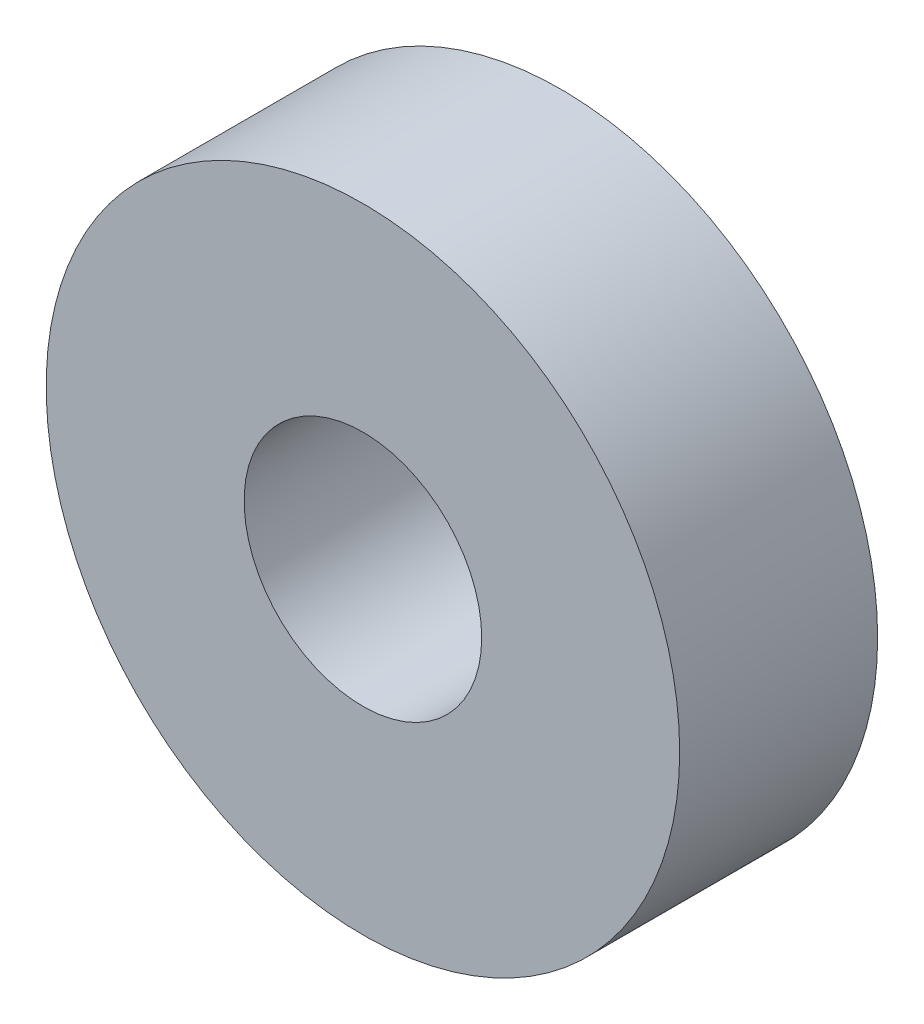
from build123d import *

# Parameters (mm, degrees)
ESQUISSE1_R             = 8
BASE_EXTRUSION_DEPTH    = 5
ESQUISSE2_R             = 3
ENL_V_MAT_EXTRU_1_DEPTH = 5


with BuildPart() as part:
    # Esquisse1 → Base-Extrusion (new body)
    with BuildSketch(Plane.XY):
        Circle(ESQUISSE1_R)
    extrude(amount=BASE_EXTRUSION_DEPTH)

    # Esquisse2 → Enl_v. mat.-Extru.1 (cut)
    with BuildSketch(Plane.XY.offset(5)):
        Circle(ESQUISSE2_R)
    extrude(amount=-ENL_V_MAT_EXTRU_1_DEPTH, mode=Mode.SUBTRACT)


solid = part.part
